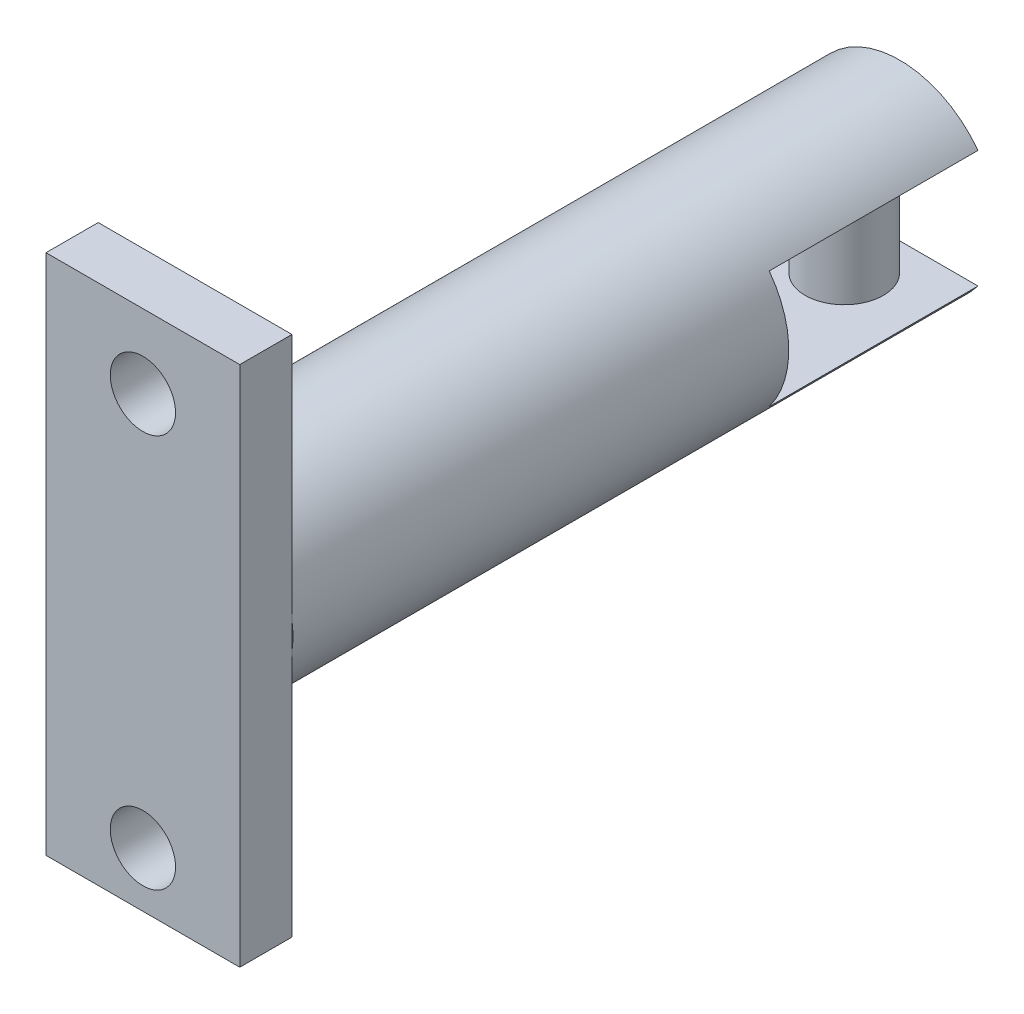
from build123d import *

# Parameters (mm, degrees)
SKETCH1_R           = 7.5
BOSS_EXTRUDE1_DEPTH = 54
SKETCH2_W           = 16.302555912
SKETCH2_H           = 9
CUT_EXTRUDE1_DEPTH  = 16
SKETCH3_R           = 3
BOSS_EXTRUDE3_DEPTH = 11
SKETCH4_W           = 14.849973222
SKETCH4_H           = 40
SKETCH4_R           = 2.5
BOSS_EXTRUDE4_DEPTH = 4


with BuildPart() as part:
    # Sketch1 → Boss-Extrude1 (new body)
    with BuildSketch(Plane.XY):
        Circle(SKETCH1_R)
    extrude(amount=BOSS_EXTRUDE1_DEPTH)

    # Sketch2 → Cut-Extrude1 (cut)
    with BuildSketch(Plane.XY):
        Rectangle(SKETCH2_W, SKETCH2_H)
    extrude(amount=CUT_EXTRUDE1_DEPTH, mode=Mode.SUBTRACT)

    # Sketch3 → Boss-Extrude3 (add)
    with BuildSketch(Plane(origin=(0, 4.5, 0), x_dir=(-1, 0, 0), z_dir=(0, -1, 0))):
        with Locations(Location((0, -4.24806539, 0), (0, 0, 270))):
            Circle(SKETCH3_R)
    extrude(amount=BOSS_EXTRUDE3_DEPTH)

    # Sketch4 → Boss-Extrude4 (add)
    with BuildSketch(Plane.XY.offset(54)):
        Rectangle(SKETCH4_W, SKETCH4_H)
        with Locations((0, -15.803277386)):
            Circle(SKETCH4_R, mode=Mode.SUBTRACT)
        with Locations((0, 14.342093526)):
            Circle(SKETCH4_R, mode=Mode.SUBTRACT)
    extrude(amount=BOSS_EXTRUDE4_DEPTH)


solid = part.part
